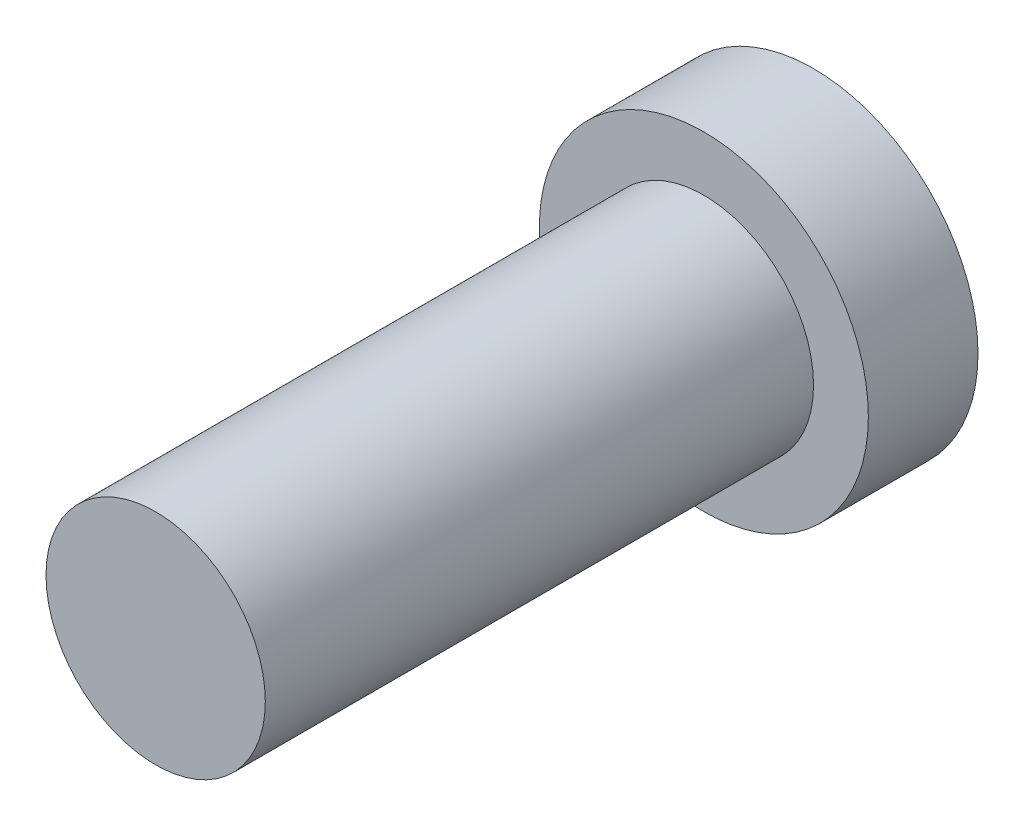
from build123d import *


with BuildPart() as part:
    # Sketch1 → Revolve1 (revolve)
    with BuildSketch(Plane(origin=(0, 0, 0), x_dir=(1, 0, 0), z_dir=(0, 1, 0))):
        Polygon((0, 0), (0, 60), (15, 60), (15, 50), (10, 50), (10, 0), align=None)
    revolve(axis=Axis((0, 0, 0), (0, 0, -1)))


solid = part.part
